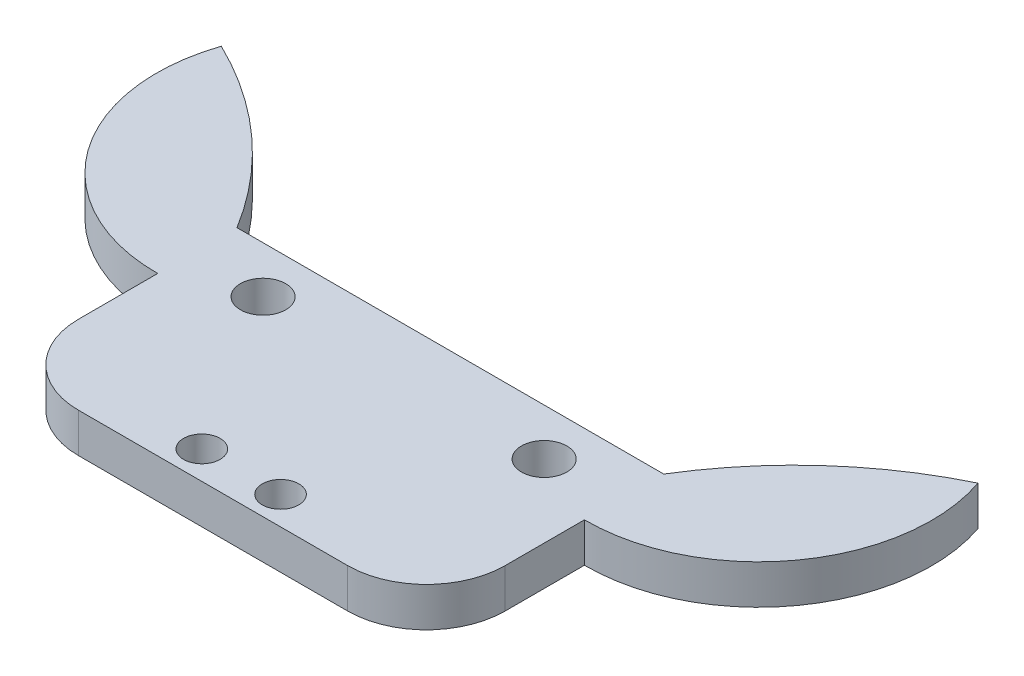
ISO-10303-21;
HEADER;
FILE_DESCRIPTION(('STEP AP214'),'2;1');
FILE_NAME('part.step','',(''),(''),'','','');
FILE_SCHEMA(('AUTOMOTIVE_DESIGN { 1 0 10303 214 1 1 1 1 }'));
ENDSEC;
DATA;
#1=APPLICATION_CONTEXT('core data for automotive mechanical design processes');
#2=APPLICATION_PROTOCOL_DEFINITION('international standard','automotive_design',2000,#1);
#3=PRODUCT_CONTEXT('',#1,'mechanical');
#4=PRODUCT('Part','Part','',(#3));
#5=PRODUCT_RELATED_PRODUCT_CATEGORY('part','',(#4));
#6=PRODUCT_DEFINITION_FORMATION('','',#4);
#7=PRODUCT_DEFINITION_CONTEXT('part definition',#1,'design');
#8=PRODUCT_DEFINITION('design','',#6,#7);
#9=PRODUCT_DEFINITION_SHAPE('','',#8);
#10=(LENGTH_UNIT() NAMED_UNIT(*) SI_UNIT(.MILLI.,.METRE.));
#11=(NAMED_UNIT(*) PLANE_ANGLE_UNIT() SI_UNIT($,.RADIAN.));
#12=(NAMED_UNIT(*) SI_UNIT($,.STERADIAN.) SOLID_ANGLE_UNIT());
#13=UNCERTAINTY_MEASURE_WITH_UNIT(LENGTH_MEASURE(1.E-05),#10,'distance_accuracy_value','');
#14=(GEOMETRIC_REPRESENTATION_CONTEXT(3) GLOBAL_UNCERTAINTY_ASSIGNED_CONTEXT((#13)) GLOBAL_UNIT_ASSIGNED_CONTEXT((#10,
#11,#12)) REPRESENTATION_CONTEXT('',''));
#15=CARTESIAN_POINT('',(0.,0.,0.));
#16=DIRECTION('',(0.,0.,1.));
#17=DIRECTION('',(1.,0.,0.));
#18=AXIS2_PLACEMENT_3D('',#15,#16,#17);
#19=CARTESIAN_POINT('',(-10.8593135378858,3.175,-28.5999581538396));
#20=DIRECTION('',(0.,1.,0.));
#21=DIRECTION('',(0.,0.,1.));
#22=AXIS2_PLACEMENT_3D('',#19,#20,#21);
#23=PLANE('',#22);
#24=CARTESIAN_POINT('',(-3.17500000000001,3.175,-24.520410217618));
#25=DIRECTION('',(0.,1.,0.));
#26=DIRECTION('',(0.,0.,1.));
#27=AXIS2_PLACEMENT_3D('',#24,#25,#26);
#28=CIRCLE('',#27,1.4732);
#29=CARTESIAN_POINT('',(-3.17500000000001,3.175,-23.047210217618));
#30=VERTEX_POINT('',#29);
#31=EDGE_CURVE('E216',#30,#30,#28,.T.);
#32=ORIENTED_EDGE('',*,*,#31,.F.);
#33=EDGE_LOOP('',(#32));
#34=FACE_BOUND('',#33,.T.);
#35=CARTESIAN_POINT('',(-11.3356124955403,3.175,-37.6203029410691));
#36=DIRECTION('',(0.,1.,0.));
#37=DIRECTION('',(0.,0.,1.));
#38=AXIS2_PLACEMENT_3D('',#35,#36,#37);
#39=CIRCLE('',#38,1.8288);
#40=CARTESIAN_POINT('',(-11.3356124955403,3.175,-35.7915029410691));
#41=VERTEX_POINT('',#40);
#42=EDGE_CURVE('E144',#41,#41,#39,.T.);
#43=ORIENTED_EDGE('',*,*,#42,.F.);
#44=EDGE_LOOP('',(#43));
#45=FACE_BOUND('',#44,.T.);
#46=CARTESIAN_POINT('',(-10.8593135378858,3.175,-28.5999581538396));
#47=DIRECTION('',(0.,1.,0.));
#48=DIRECTION('',(0.,0.,1.));
#49=AXIS2_PLACEMENT_3D('',#46,#47,#48);
#50=CIRCLE('',#49,6.35);
#51=CARTESIAN_POINT('',(-17.2093135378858,3.175,-28.5999581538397));
#52=VERTEX_POINT('',#51);
#53=CARTESIAN_POINT('',(-10.8593135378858,3.175,-22.2499581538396));
#54=VERTEX_POINT('',#53);
#55=EDGE_CURVE('E159',#52,#54,#50,.T.);
#56=ORIENTED_EDGE('',*,*,#55,.T.);
#57=DIRECTION('',(1.,0.,0.));
#58=VECTOR('',#57,1.);
#59=CARTESIAN_POINT('',(-10.8593135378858,3.175,-22.2499581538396));
#60=LINE('',#59,#58);
#61=CARTESIAN_POINT('',(10.8593135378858,3.175,-22.2499581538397));
#62=VERTEX_POINT('',#61);
#63=EDGE_CURVE('E97',#54,#62,#60,.T.);
#64=ORIENTED_EDGE('',*,*,#63,.T.);
#65=CARTESIAN_POINT('',(10.8593135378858,3.175,-28.5999581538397));
#66=DIRECTION('',(0.,1.,0.));
#67=DIRECTION('',(0.,0.,1.));
#68=AXIS2_PLACEMENT_3D('',#65,#66,#67);
#69=CIRCLE('',#68,6.35);
#70=CARTESIAN_POINT('',(17.2093135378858,3.175,-28.5999581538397));
#71=VERTEX_POINT('',#70);
#72=EDGE_CURVE('E180',#62,#71,#69,.T.);
#73=ORIENTED_EDGE('',*,*,#72,.T.);
#74=DIRECTION('',(0.,0.,-1.));
#75=VECTOR('',#74,1.);
#76=CARTESIAN_POINT('',(17.2093135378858,3.175,-28.5999581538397));
#77=LINE('',#76,#75);
#78=CARTESIAN_POINT('',(17.2093135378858,3.175,-34.9960115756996));
#79=VERTEX_POINT('',#78);
#80=EDGE_CURVE('E199',#71,#79,#77,.T.);
#81=ORIENTED_EDGE('',*,*,#80,.T.);
#82=CARTESIAN_POINT('',(17.3016719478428,3.175,-48.9506822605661));
#83=DIRECTION('',(0.,1.,0.));
#84=DIRECTION('',(0.,0.,-1.));
#85=AXIS2_PLACEMENT_3D('',#82,#83,#84);
#86=CIRCLE('',#85,13.954976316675);
#87=CARTESIAN_POINT('',(30.5175352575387,3.175,-53.4320125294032));
#88=VERTEX_POINT('',#87);
#89=EDGE_CURVE('E196',#79,#88,#86,.T.);
#90=ORIENTED_EDGE('',*,*,#89,.T.);
#91=CARTESIAN_POINT('',(44.3873294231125,3.175,-24.7261692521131));
#92=DIRECTION('',(0.,1.,0.));
#93=DIRECTION('',(0.,0.,1.));
#94=AXIS2_PLACEMENT_3D('',#91,#92,#93);
#95=CIRCLE('',#94,31.880975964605);
#96=CARTESIAN_POINT('',(17.2093135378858,3.175,-41.3920649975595));
#97=VERTEX_POINT('',#96);
#98=EDGE_CURVE('E198',#88,#97,#95,.T.);
#99=ORIENTED_EDGE('',*,*,#98,.T.);
#100=DIRECTION('',(-1.,0.,0.));
#101=VECTOR('',#100,1.);
#102=CARTESIAN_POINT('',(-17.2093135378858,3.175,-41.3920649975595));
#103=LINE('',#102,#101);
#104=CARTESIAN_POINT('',(-17.2093135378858,3.175,-41.3920649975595));
#105=VERTEX_POINT('',#104);
#106=EDGE_CURVE('E122',#97,#105,#103,.T.);
#107=ORIENTED_EDGE('',*,*,#106,.T.);
#108=CARTESIAN_POINT('',(-44.3873294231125,3.175,-24.7261692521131));
#109=DIRECTION('',(0.,1.,0.));
#110=DIRECTION('',(0.,0.,-1.));
#111=AXIS2_PLACEMENT_3D('',#108,#109,#110);
#112=CIRCLE('',#111,31.880975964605);
#113=CARTESIAN_POINT('',(-30.5175352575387,3.175,-53.4320125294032));
#114=VERTEX_POINT('',#113);
#115=EDGE_CURVE('E116',#105,#114,#112,.T.);
#116=ORIENTED_EDGE('',*,*,#115,.T.);
#117=CARTESIAN_POINT('',(-17.3016719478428,3.175,-48.9506822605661));
#118=DIRECTION('',(0.,1.,0.));
#119=DIRECTION('',(0.,0.,1.));
#120=AXIS2_PLACEMENT_3D('',#117,#118,#119);
#121=CIRCLE('',#120,13.954976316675);
#122=CARTESIAN_POINT('',(-17.2093135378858,3.175,-34.9960115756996));
#123=VERTEX_POINT('',#122);
#124=EDGE_CURVE('E120',#114,#123,#121,.T.);
#125=ORIENTED_EDGE('',*,*,#124,.T.);
#126=DIRECTION('',(0.,0.,1.));
#127=VECTOR('',#126,1.);
#128=CARTESIAN_POINT('',(-17.2093135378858,3.175,-34.9960115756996));
#129=LINE('',#128,#127);
#130=EDGE_CURVE('E48',#123,#52,#129,.T.);
#131=ORIENTED_EDGE('',*,*,#130,.T.);
#132=EDGE_LOOP('',(#56,#64,#73,#81,#90,#99,#107,#116,#125,#131));
#133=FACE_BOUND('',#132,.T.);
#134=CARTESIAN_POINT('',(11.3356124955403,3.175,-37.6203029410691));
#135=DIRECTION('',(0.,1.,0.));
#136=DIRECTION('',(0.,0.,-1.));
#137=AXIS2_PLACEMENT_3D('',#134,#135,#136);
#138=CIRCLE('',#137,1.8288);
#139=CARTESIAN_POINT('',(11.3356124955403,3.175,-39.4491029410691));
#140=VERTEX_POINT('',#139);
#141=EDGE_CURVE('E210',#140,#140,#138,.T.);
#142=ORIENTED_EDGE('',*,*,#141,.F.);
#143=EDGE_LOOP('',(#142));
#144=FACE_BOUND('',#143,.T.);
#145=CARTESIAN_POINT('',(3.175,3.175,-24.520410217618));
#146=DIRECTION('',(0.,1.,0.));
#147=DIRECTION('',(0.,0.,-1.));
#148=AXIS2_PLACEMENT_3D('',#145,#146,#147);
#149=CIRCLE('',#148,1.4732);
#150=CARTESIAN_POINT('',(3.175,3.175,-25.993610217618));
#151=VERTEX_POINT('',#150);
#152=EDGE_CURVE('E222',#151,#151,#149,.T.);
#153=ORIENTED_EDGE('',*,*,#152,.F.);
#154=EDGE_LOOP('',(#153));
#155=FACE_BOUND('',#154,.T.);
#156=ADVANCED_FACE('F31',(#34,#45,#133,#144,#155),#23,.T.);
#157=CARTESIAN_POINT('',(-10.8593135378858,0.,-28.5999581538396));
#158=DIRECTION('',(0.,1.,0.));
#159=DIRECTION('',(0.,0.,1.));
#160=AXIS2_PLACEMENT_3D('',#157,#158,#159);
#161=PLANE('',#160);
#162=CARTESIAN_POINT('',(-3.17500000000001,0.,-24.520410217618));
#163=DIRECTION('',(0.,1.,0.));
#164=DIRECTION('',(0.,0.,1.));
#165=AXIS2_PLACEMENT_3D('',#162,#163,#164);
#166=CIRCLE('',#165,1.4732);
#167=CARTESIAN_POINT('',(-3.17500000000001,0.,-23.047210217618));
#168=VERTEX_POINT('',#167);
#169=EDGE_CURVE('E219',#168,#168,#166,.T.);
#170=ORIENTED_EDGE('',*,*,#169,.T.);
#171=EDGE_LOOP('',(#170));
#172=FACE_BOUND('',#171,.T.);
#173=CARTESIAN_POINT('',(-11.3356124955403,0.,-37.6203029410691));
#174=DIRECTION('',(0.,1.,0.));
#175=DIRECTION('',(0.,0.,1.));
#176=AXIS2_PLACEMENT_3D('',#173,#174,#175);
#177=CIRCLE('',#176,1.8288);
#178=CARTESIAN_POINT('',(-11.3356124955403,0.,-35.7915029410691));
#179=VERTEX_POINT('',#178);
#180=EDGE_CURVE('E207',#179,#179,#177,.T.);
#181=ORIENTED_EDGE('',*,*,#180,.T.);
#182=EDGE_LOOP('',(#181));
#183=FACE_BOUND('',#182,.T.);
#184=CARTESIAN_POINT('',(-10.8593135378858,0.,-28.5999581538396));
#185=DIRECTION('',(0.,1.,0.));
#186=DIRECTION('',(0.,0.,1.));
#187=AXIS2_PLACEMENT_3D('',#184,#185,#186);
#188=CIRCLE('',#187,6.35);
#189=CARTESIAN_POINT('',(-17.2093135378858,0.,-28.5999581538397));
#190=VERTEX_POINT('',#189);
#191=CARTESIAN_POINT('',(-10.8593135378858,0.,-22.2499581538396));
#192=VERTEX_POINT('',#191);
#193=EDGE_CURVE('E140',#190,#192,#188,.T.);
#194=ORIENTED_EDGE('',*,*,#193,.F.);
#195=DIRECTION('',(0.,0.,1.));
#196=VECTOR('',#195,1.);
#197=CARTESIAN_POINT('',(-17.2093135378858,0.,-34.9960115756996));
#198=LINE('',#197,#196);
#199=CARTESIAN_POINT('',(-17.2093135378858,0.,-34.9960115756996));
#200=VERTEX_POINT('',#199);
#201=EDGE_CURVE('E89',#200,#190,#198,.T.);
#202=ORIENTED_EDGE('',*,*,#201,.F.);
#203=CARTESIAN_POINT('',(-17.3016719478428,0.,-48.9506822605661));
#204=DIRECTION('',(0.,1.,0.));
#205=DIRECTION('',(0.,0.,1.));
#206=AXIS2_PLACEMENT_3D('',#203,#204,#205);
#207=CIRCLE('',#206,13.954976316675);
#208=CARTESIAN_POINT('',(-30.5175352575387,0.,-53.4320125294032));
#209=VERTEX_POINT('',#208);
#210=EDGE_CURVE('E83',#209,#200,#207,.T.);
#211=ORIENTED_EDGE('',*,*,#210,.F.);
#212=CARTESIAN_POINT('',(-44.3873294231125,0.,-24.7261692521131));
#213=DIRECTION('',(0.,1.,0.));
#214=DIRECTION('',(0.,0.,-1.));
#215=AXIS2_PLACEMENT_3D('',#212,#213,#214);
#216=CIRCLE('',#215,31.880975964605);
#217=CARTESIAN_POINT('',(-17.2093135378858,0.,-41.3920649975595));
#218=VERTEX_POINT('',#217);
#219=EDGE_CURVE('E130',#218,#209,#216,.T.);
#220=ORIENTED_EDGE('',*,*,#219,.F.);
#221=DIRECTION('',(-1.,0.,0.));
#222=VECTOR('',#221,1.);
#223=CARTESIAN_POINT('',(-17.2093135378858,0.,-41.3920649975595));
#224=LINE('',#223,#222);
#225=CARTESIAN_POINT('',(17.2093135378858,0.,-41.3920649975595));
#226=VERTEX_POINT('',#225);
#227=EDGE_CURVE('E154',#226,#218,#224,.T.);
#228=ORIENTED_EDGE('',*,*,#227,.F.);
#229=CARTESIAN_POINT('',(44.3873294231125,0.,-24.7261692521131));
#230=DIRECTION('',(0.,1.,0.));
#231=DIRECTION('',(0.,0.,1.));
#232=AXIS2_PLACEMENT_3D('',#229,#230,#231);
#233=CIRCLE('',#232,31.880975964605);
#234=CARTESIAN_POINT('',(30.5175352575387,0.,-53.4320125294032));
#235=VERTEX_POINT('',#234);
#236=EDGE_CURVE('E152',#235,#226,#233,.T.);
#237=ORIENTED_EDGE('',*,*,#236,.F.);
#238=CARTESIAN_POINT('',(17.3016719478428,0.,-48.9506822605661));
#239=DIRECTION('',(0.,1.,0.));
#240=DIRECTION('',(0.,0.,-1.));
#241=AXIS2_PLACEMENT_3D('',#238,#239,#240);
#242=CIRCLE('',#241,13.954976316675);
#243=CARTESIAN_POINT('',(17.2093135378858,0.,-34.9960115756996));
#244=VERTEX_POINT('',#243);
#245=EDGE_CURVE('E150',#244,#235,#242,.T.);
#246=ORIENTED_EDGE('',*,*,#245,.F.);
#247=DIRECTION('',(0.,0.,-1.));
#248=VECTOR('',#247,1.);
#249=CARTESIAN_POINT('',(17.2093135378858,0.,-28.5999581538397));
#250=LINE('',#249,#248);
#251=CARTESIAN_POINT('',(17.2093135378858,0.,-28.5999581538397));
#252=VERTEX_POINT('',#251);
#253=EDGE_CURVE('E148',#252,#244,#250,.T.);
#254=ORIENTED_EDGE('',*,*,#253,.F.);
#255=CARTESIAN_POINT('',(10.8593135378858,0.,-28.5999581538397));
#256=DIRECTION('',(0.,1.,0.));
#257=DIRECTION('',(0.,0.,1.));
#258=AXIS2_PLACEMENT_3D('',#255,#256,#257);
#259=CIRCLE('',#258,6.35);
#260=CARTESIAN_POINT('',(10.8593135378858,0.,-22.2499581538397));
#261=VERTEX_POINT('',#260);
#262=EDGE_CURVE('E146',#261,#252,#259,.T.);
#263=ORIENTED_EDGE('',*,*,#262,.F.);
#264=DIRECTION('',(1.,0.,0.));
#265=VECTOR('',#264,1.);
#266=CARTESIAN_POINT('',(-10.8593135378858,0.,-22.2499581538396));
#267=LINE('',#266,#265);
#268=EDGE_CURVE('E143',#192,#261,#267,.T.);
#269=ORIENTED_EDGE('',*,*,#268,.F.);
#270=EDGE_LOOP('',(#194,#202,#211,#220,#228,#237,#246,#254,#263,#269));
#271=FACE_BOUND('',#270,.T.);
#272=CARTESIAN_POINT('',(11.3356124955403,0.,-37.6203029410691));
#273=DIRECTION('',(0.,1.,0.));
#274=DIRECTION('',(0.,0.,-1.));
#275=AXIS2_PLACEMENT_3D('',#272,#273,#274);
#276=CIRCLE('',#275,1.8288);
#277=CARTESIAN_POINT('',(11.3356124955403,0.,-39.4491029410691));
#278=VERTEX_POINT('',#277);
#279=EDGE_CURVE('E213',#278,#278,#276,.T.);
#280=ORIENTED_EDGE('',*,*,#279,.T.);
#281=EDGE_LOOP('',(#280));
#282=FACE_BOUND('',#281,.T.);
#283=CARTESIAN_POINT('',(3.175,0.,-24.520410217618));
#284=DIRECTION('',(0.,1.,0.));
#285=DIRECTION('',(0.,0.,-1.));
#286=AXIS2_PLACEMENT_3D('',#283,#284,#285);
#287=CIRCLE('',#286,1.4732);
#288=CARTESIAN_POINT('',(3.175,0.,-25.993610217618));
#289=VERTEX_POINT('',#288);
#290=EDGE_CURVE('E225',#289,#289,#287,.T.);
#291=ORIENTED_EDGE('',*,*,#290,.T.);
#292=EDGE_LOOP('',(#291));
#293=FACE_BOUND('',#292,.T.);
#294=ADVANCED_FACE('F184',(#172,#183,#271,#282,#293),#161,.F.);
#295=CARTESIAN_POINT('',(-10.8593135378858,3.175,-28.5999581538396));
#296=DIRECTION('',(0.,-1.,0.));
#297=DIRECTION('',(0.,0.,-1.));
#298=AXIS2_PLACEMENT_3D('',#295,#296,#297);
#299=CYLINDRICAL_SURFACE('',#298,6.35);
#300=ORIENTED_EDGE('',*,*,#193,.T.);
#301=DIRECTION('',(0.,-1.,0.));
#302=VECTOR('',#301,1.);
#303=CARTESIAN_POINT('',(-10.8593135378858,3.175,-22.2499581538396));
#304=LINE('',#303,#302);
#305=EDGE_CURVE('E11',#54,#192,#304,.T.);
#306=ORIENTED_EDGE('',*,*,#305,.F.);
#307=ORIENTED_EDGE('',*,*,#55,.F.);
#308=DIRECTION('',(0.,-1.,0.));
#309=VECTOR('',#308,1.);
#310=CARTESIAN_POINT('',(-17.2093135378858,3.175,-28.5999581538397));
#311=LINE('',#310,#309);
#312=EDGE_CURVE('E136',#52,#190,#311,.T.);
#313=ORIENTED_EDGE('',*,*,#312,.T.);
#314=EDGE_LOOP('',(#300,#306,#307,#313));
#315=FACE_BOUND('',#314,.T.);
#316=ADVANCED_FACE('F33',(#315),#299,.T.);
#317=CARTESIAN_POINT('',(-10.8593135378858,3.175,-22.2499581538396));
#318=DIRECTION('',(0.,0.,-1.));
#319=DIRECTION('',(-1.,0.,0.));
#320=AXIS2_PLACEMENT_3D('',#317,#318,#319);
#321=PLANE('',#320);
#322=ORIENTED_EDGE('',*,*,#268,.T.);
#323=DIRECTION('',(0.,-1.,0.));
#324=VECTOR('',#323,1.);
#325=CARTESIAN_POINT('',(10.8593135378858,3.175,-22.2499581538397));
#326=LINE('',#325,#324);
#327=EDGE_CURVE('E40',#62,#261,#326,.T.);
#328=ORIENTED_EDGE('',*,*,#327,.F.);
#329=ORIENTED_EDGE('',*,*,#63,.F.);
#330=ORIENTED_EDGE('',*,*,#305,.T.);
#331=EDGE_LOOP('',(#322,#328,#329,#330));
#332=FACE_BOUND('',#331,.T.);
#333=ADVANCED_FACE('F268',(#332),#321,.F.);
#334=CARTESIAN_POINT('',(10.8593135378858,3.175,-28.5999581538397));
#335=DIRECTION('',(0.,-1.,0.));
#336=DIRECTION('',(0.,0.,-1.));
#337=AXIS2_PLACEMENT_3D('',#334,#335,#336);
#338=CYLINDRICAL_SURFACE('',#337,6.35);
#339=ORIENTED_EDGE('',*,*,#262,.T.);
#340=DIRECTION('',(0.,-1.,0.));
#341=VECTOR('',#340,1.);
#342=CARTESIAN_POINT('',(17.2093135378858,3.175,-28.5999581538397));
#343=LINE('',#342,#341);
#344=EDGE_CURVE('E172',#71,#252,#343,.T.);
#345=ORIENTED_EDGE('',*,*,#344,.F.);
#346=ORIENTED_EDGE('',*,*,#72,.F.);
#347=ORIENTED_EDGE('',*,*,#327,.T.);
#348=EDGE_LOOP('',(#339,#345,#346,#347));
#349=FACE_BOUND('',#348,.T.);
#350=ADVANCED_FACE('F178',(#349),#338,.T.);
#351=CARTESIAN_POINT('',(17.2093135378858,3.175,-28.5999581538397));
#352=DIRECTION('',(-1.,0.,0.));
#353=DIRECTION('',(0.,0.,1.));
#354=AXIS2_PLACEMENT_3D('',#351,#352,#353);
#355=PLANE('',#354);
#356=ORIENTED_EDGE('',*,*,#253,.T.);
#357=DIRECTION('',(0.,-1.,0.));
#358=VECTOR('',#357,1.);
#359=CARTESIAN_POINT('',(17.2093135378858,3.175,-34.9960115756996));
#360=LINE('',#359,#358);
#361=EDGE_CURVE('E169',#79,#244,#360,.T.);
#362=ORIENTED_EDGE('',*,*,#361,.F.);
#363=ORIENTED_EDGE('',*,*,#80,.F.);
#364=ORIENTED_EDGE('',*,*,#344,.T.);
#365=EDGE_LOOP('',(#356,#362,#363,#364));
#366=FACE_BOUND('',#365,.T.);
#367=ADVANCED_FACE('F190',(#366),#355,.F.);
#368=CARTESIAN_POINT('',(17.3016719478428,3.175,-48.9506822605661));
#369=DIRECTION('',(0.,-1.,0.));
#370=DIRECTION('',(0.,0.,-1.));
#371=AXIS2_PLACEMENT_3D('',#368,#369,#370);
#372=CYLINDRICAL_SURFACE('',#371,13.954976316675);
#373=ORIENTED_EDGE('',*,*,#245,.T.);
#374=DIRECTION('',(0.,-1.,0.));
#375=VECTOR('',#374,1.);
#376=CARTESIAN_POINT('',(30.5175352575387,3.175,-53.4320125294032));
#377=LINE('',#376,#375);
#378=EDGE_CURVE('E166',#88,#235,#377,.T.);
#379=ORIENTED_EDGE('',*,*,#378,.F.);
#380=ORIENTED_EDGE('',*,*,#89,.F.);
#381=ORIENTED_EDGE('',*,*,#361,.T.);
#382=EDGE_LOOP('',(#373,#379,#380,#381));
#383=FACE_BOUND('',#382,.T.);
#384=ADVANCED_FACE('F194',(#383),#372,.T.);
#385=CARTESIAN_POINT('',(44.3873294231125,3.175,-24.7261692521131));
#386=DIRECTION('',(0.,-1.,0.));
#387=DIRECTION('',(0.,0.,-1.));
#388=AXIS2_PLACEMENT_3D('',#385,#386,#387);
#389=CYLINDRICAL_SURFACE('',#388,31.880975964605);
#390=ORIENTED_EDGE('',*,*,#236,.T.);
#391=DIRECTION('',(0.,-1.,0.));
#392=VECTOR('',#391,1.);
#393=CARTESIAN_POINT('',(17.2093135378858,3.175,-41.3920649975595));
#394=LINE('',#393,#392);
#395=EDGE_CURVE('E163',#97,#226,#394,.T.);
#396=ORIENTED_EDGE('',*,*,#395,.F.);
#397=ORIENTED_EDGE('',*,*,#98,.F.);
#398=ORIENTED_EDGE('',*,*,#378,.T.);
#399=EDGE_LOOP('',(#390,#396,#397,#398));
#400=FACE_BOUND('',#399,.T.);
#401=ADVANCED_FACE('F258',(#400),#389,.T.);
#402=CARTESIAN_POINT('',(-17.2093135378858,3.175,-41.3920649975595));
#403=DIRECTION('',(0.,0.,1.));
#404=DIRECTION('',(1.,0.,0.));
#405=AXIS2_PLACEMENT_3D('',#402,#403,#404);
#406=PLANE('',#405);
#407=ORIENTED_EDGE('',*,*,#227,.T.);
#408=DIRECTION('',(0.,-1.,0.));
#409=VECTOR('',#408,1.);
#410=CARTESIAN_POINT('',(-17.2093135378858,3.175,-41.3920649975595));
#411=LINE('',#410,#409);
#412=EDGE_CURVE('E131',#105,#218,#411,.T.);
#413=ORIENTED_EDGE('',*,*,#412,.F.);
#414=ORIENTED_EDGE('',*,*,#106,.F.);
#415=ORIENTED_EDGE('',*,*,#395,.T.);
#416=EDGE_LOOP('',(#407,#413,#414,#415));
#417=FACE_BOUND('',#416,.T.);
#418=ADVANCED_FACE('F255',(#417),#406,.F.);
#419=CARTESIAN_POINT('',(-44.3873294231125,3.175,-24.7261692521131));
#420=DIRECTION('',(0.,-1.,0.));
#421=DIRECTION('',(0.,0.,-1.));
#422=AXIS2_PLACEMENT_3D('',#419,#420,#421);
#423=CYLINDRICAL_SURFACE('',#422,31.880975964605);
#424=ORIENTED_EDGE('',*,*,#219,.T.);
#425=DIRECTION('',(0.,-1.,0.));
#426=VECTOR('',#425,1.);
#427=CARTESIAN_POINT('',(-30.5175352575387,3.175,-53.4320125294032));
#428=LINE('',#427,#426);
#429=EDGE_CURVE('E127',#114,#209,#428,.T.);
#430=ORIENTED_EDGE('',*,*,#429,.F.);
#431=ORIENTED_EDGE('',*,*,#115,.F.);
#432=ORIENTED_EDGE('',*,*,#412,.T.);
#433=EDGE_LOOP('',(#424,#430,#431,#432));
#434=FACE_BOUND('',#433,.T.);
#435=ADVANCED_FACE('F128',(#434),#423,.T.);
#436=CARTESIAN_POINT('',(-17.3016719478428,3.175,-48.9506822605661));
#437=DIRECTION('',(0.,-1.,0.));
#438=DIRECTION('',(0.,0.,-1.));
#439=AXIS2_PLACEMENT_3D('',#436,#437,#438);
#440=CYLINDRICAL_SURFACE('',#439,13.954976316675);
#441=ORIENTED_EDGE('',*,*,#210,.T.);
#442=DIRECTION('',(0.,-1.,0.));
#443=VECTOR('',#442,1.);
#444=CARTESIAN_POINT('',(-17.2093135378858,3.175,-34.9960115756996));
#445=LINE('',#444,#443);
#446=EDGE_CURVE('E132',#123,#200,#445,.T.);
#447=ORIENTED_EDGE('',*,*,#446,.F.);
#448=ORIENTED_EDGE('',*,*,#124,.F.);
#449=ORIENTED_EDGE('',*,*,#429,.T.);
#450=EDGE_LOOP('',(#441,#447,#448,#449));
#451=FACE_BOUND('',#450,.T.);
#452=ADVANCED_FACE('F134',(#451),#440,.T.);
#453=CARTESIAN_POINT('',(-17.2093135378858,3.175,-34.9960115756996));
#454=DIRECTION('',(1.,0.,0.));
#455=DIRECTION('',(0.,0.,-1.));
#456=AXIS2_PLACEMENT_3D('',#453,#454,#455);
#457=PLANE('',#456);
#458=ORIENTED_EDGE('',*,*,#201,.T.);
#459=ORIENTED_EDGE('',*,*,#312,.F.);
#460=ORIENTED_EDGE('',*,*,#130,.F.);
#461=ORIENTED_EDGE('',*,*,#446,.T.);
#462=EDGE_LOOP('',(#458,#459,#460,#461));
#463=FACE_BOUND('',#462,.T.);
#464=ADVANCED_FACE('F248',(#463),#457,.F.);
#465=CARTESIAN_POINT('',(-11.3356124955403,3.175,-37.6203029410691));
#466=DIRECTION('',(0.,-1.,0.));
#467=DIRECTION('',(0.,0.,-1.));
#468=AXIS2_PLACEMENT_3D('',#465,#466,#467);
#469=CYLINDRICAL_SURFACE('',#468,1.8288);
#470=ORIENTED_EDGE('',*,*,#42,.T.);
#471=EDGE_LOOP('',(#470));
#472=FACE_BOUND('',#471,.T.);
#473=ORIENTED_EDGE('',*,*,#180,.F.);
#474=EDGE_LOOP('',(#473));
#475=FACE_BOUND('',#474,.T.);
#476=ADVANCED_FACE('F245',(#472,#475),#469,.F.);
#477=CARTESIAN_POINT('',(11.3356124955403,3.175,-37.6203029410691));
#478=DIRECTION('',(0.,-1.,0.));
#479=DIRECTION('',(0.,0.,-1.));
#480=AXIS2_PLACEMENT_3D('',#477,#478,#479);
#481=CYLINDRICAL_SURFACE('',#480,1.8288);
#482=ORIENTED_EDGE('',*,*,#141,.T.);
#483=EDGE_LOOP('',(#482));
#484=FACE_BOUND('',#483,.T.);
#485=ORIENTED_EDGE('',*,*,#279,.F.);
#486=EDGE_LOOP('',(#485));
#487=FACE_BOUND('',#486,.T.);
#488=ADVANCED_FACE('F344',(#484,#487),#481,.F.);
#489=CARTESIAN_POINT('',(-3.17500000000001,3.175,-24.520410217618));
#490=DIRECTION('',(0.,-1.,0.));
#491=DIRECTION('',(0.,0.,-1.));
#492=AXIS2_PLACEMENT_3D('',#489,#490,#491);
#493=CYLINDRICAL_SURFACE('',#492,1.4732);
#494=ORIENTED_EDGE('',*,*,#31,.T.);
#495=EDGE_LOOP('',(#494));
#496=FACE_BOUND('',#495,.T.);
#497=ORIENTED_EDGE('',*,*,#169,.F.);
#498=EDGE_LOOP('',(#497));
#499=FACE_BOUND('',#498,.T.);
#500=ADVANCED_FACE('F352',(#496,#499),#493,.F.);
#501=CARTESIAN_POINT('',(3.175,3.175,-24.520410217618));
#502=DIRECTION('',(0.,-1.,0.));
#503=DIRECTION('',(0.,0.,-1.));
#504=AXIS2_PLACEMENT_3D('',#501,#502,#503);
#505=CYLINDRICAL_SURFACE('',#504,1.4732);
#506=ORIENTED_EDGE('',*,*,#152,.T.);
#507=EDGE_LOOP('',(#506));
#508=FACE_BOUND('',#507,.T.);
#509=ORIENTED_EDGE('',*,*,#290,.F.);
#510=EDGE_LOOP('',(#509));
#511=FACE_BOUND('',#510,.T.);
#512=ADVANCED_FACE('F231',(#508,#511),#505,.F.);
#513=CLOSED_SHELL('',(#156,#294,#316,#333,#350,#367,#384,#401,#418,#435,#452,#464,#476,#488,
#500,#512));
#514=MANIFOLD_SOLID_BREP('B2',#513);
#515=ADVANCED_BREP_SHAPE_REPRESENTATION('',(#18,#514),#14);
#516=SHAPE_DEFINITION_REPRESENTATION(#9,#515);
ENDSEC;
END-ISO-10303-21;
